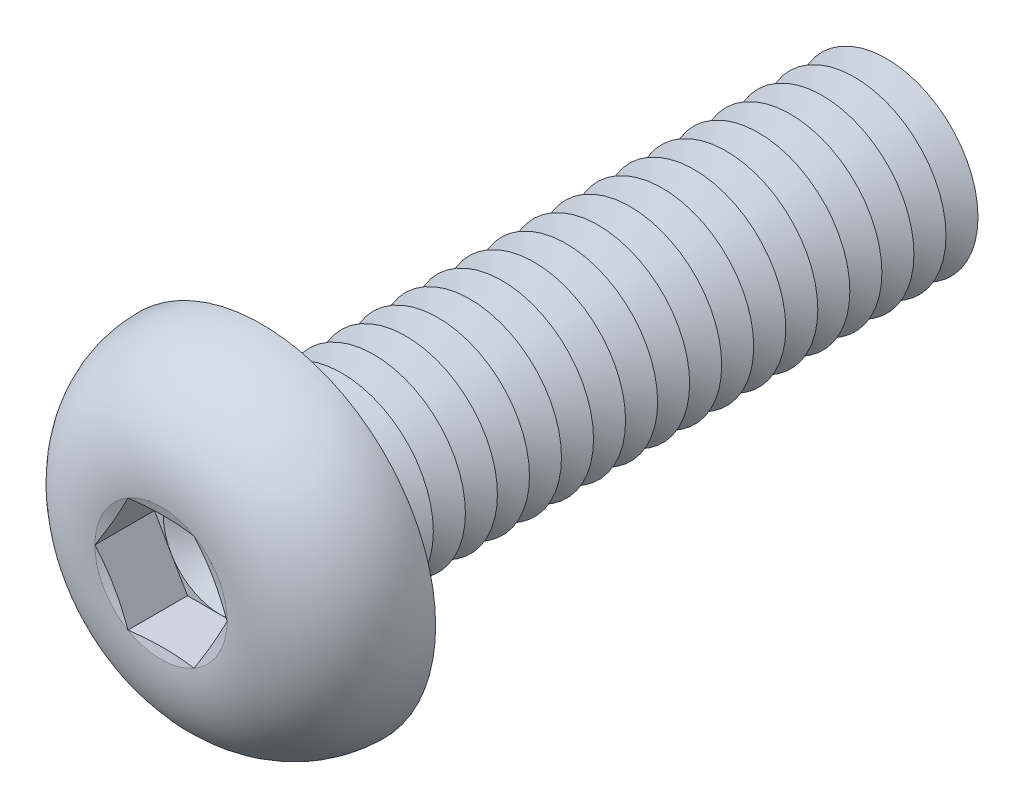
ISO-10303-21;
HEADER;
FILE_DESCRIPTION(('STEP AP214'),'2;1');
FILE_NAME('part.step','',(''),(''),'','','');
FILE_SCHEMA(('AUTOMOTIVE_DESIGN { 1 0 10303 214 1 1 1 1 }'));
ENDSEC;
DATA;
#1=APPLICATION_CONTEXT('core data for automotive mechanical design processes');
#2=APPLICATION_PROTOCOL_DEFINITION('international standard','automotive_design',2000,#1);
#3=PRODUCT_CONTEXT('',#1,'mechanical');
#4=PRODUCT('Part','Part','',(#3));
#5=PRODUCT_RELATED_PRODUCT_CATEGORY('part','',(#4));
#6=PRODUCT_DEFINITION_FORMATION('','',#4);
#7=PRODUCT_DEFINITION_CONTEXT('part definition',#1,'design');
#8=PRODUCT_DEFINITION('design','',#6,#7);
#9=PRODUCT_DEFINITION_SHAPE('','',#8);
#10=(LENGTH_UNIT() NAMED_UNIT(*) SI_UNIT(.MILLI.,.METRE.));
#11=(NAMED_UNIT(*) PLANE_ANGLE_UNIT() SI_UNIT($,.RADIAN.));
#12=(NAMED_UNIT(*) SI_UNIT($,.STERADIAN.) SOLID_ANGLE_UNIT());
#13=UNCERTAINTY_MEASURE_WITH_UNIT(LENGTH_MEASURE(1.E-05),#10,'distance_accuracy_value','');
#14=(GEOMETRIC_REPRESENTATION_CONTEXT(3) GLOBAL_UNCERTAINTY_ASSIGNED_CONTEXT((#13)) GLOBAL_UNIT_ASSIGNED_CONTEXT((#10,
#11,#12)) REPRESENTATION_CONTEXT('',''));
#15=CARTESIAN_POINT('',(0.,0.,0.));
#16=DIRECTION('',(0.,0.,1.));
#17=DIRECTION('',(1.,0.,0.));
#18=AXIS2_PLACEMENT_3D('',#15,#16,#17);
#19=CARTESIAN_POINT('',(0.,0.,0.9));
#20=DIRECTION('',(0.,0.,1.));
#21=DIRECTION('',(1.,0.,0.));
#22=AXIS2_PLACEMENT_3D('',#19,#20,#21);
#23=PLANE('',#22);
#24=CARTESIAN_POINT('',(0.,0.,0.9));
#25=DIRECTION('',(0.,0.,1.));
#26=DIRECTION('',(1.,0.,0.));
#27=AXIS2_PLACEMENT_3D('',#24,#25,#26);
#28=CIRCLE('',#27,1.24999941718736);
#29=CARTESIAN_POINT('',(1.08253125,0.624999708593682,0.9));
#30=VERTEX_POINT('',#29);
#31=CARTESIAN_POINT('',(0.,1.24999941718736,0.9));
#32=VERTEX_POINT('',#31);
#33=EDGE_CURVE('E118',#30,#32,#28,.T.);
#34=ORIENTED_EDGE('',*,*,#33,.F.);
#35=DIRECTION('',(-0.5,0.866025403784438,0.));
#36=VECTOR('',#35,1.);
#37=CARTESIAN_POINT('',(1.443375,0.,0.9));
#38=LINE('',#37,#36);
#39=CARTESIAN_POINT('',(0.7216875,1.24999941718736,0.9));
#40=VERTEX_POINT('',#39);
#41=EDGE_CURVE('E125',#30,#40,#38,.T.);
#42=ORIENTED_EDGE('',*,*,#41,.T.);
#43=DIRECTION('',(-1.,0.,0.));
#44=VECTOR('',#43,1.);
#45=CARTESIAN_POINT('',(0.7216875,1.24999941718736,0.9));
#46=LINE('',#45,#44);
#47=EDGE_CURVE('E136',#40,#32,#46,.T.);
#48=ORIENTED_EDGE('',*,*,#47,.T.);
#49=EDGE_LOOP('',(#34,#42,#48));
#50=FACE_BOUND('',#49,.T.);
#51=ADVANCED_FACE('F39',(#50),#23,.T.);
#52=CARTESIAN_POINT('',(0.,0.,0.9));
#53=DIRECTION('',(0.,0.,1.));
#54=DIRECTION('',(1.,0.,0.));
#55=AXIS2_PLACEMENT_3D('',#52,#53,#54);
#56=CIRCLE('',#55,1.24999941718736);
#57=CARTESIAN_POINT('',(-1.08253125,0.624999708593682,0.9));
#58=VERTEX_POINT('',#57);
#59=EDGE_CURVE('E11',#32,#58,#56,.T.);
#60=ORIENTED_EDGE('',*,*,#59,.F.);
#61=CARTESIAN_POINT('',(-0.721687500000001,1.24999941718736,0.9));
#62=VERTEX_POINT('',#61);
#63=EDGE_CURVE('E131',#32,#62,#46,.T.);
#64=ORIENTED_EDGE('',*,*,#63,.T.);
#65=DIRECTION('',(-0.5,-0.866025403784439,0.));
#66=VECTOR('',#65,1.);
#67=CARTESIAN_POINT('',(-0.721687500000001,1.24999941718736,0.9));
#68=LINE('',#67,#66);
#69=EDGE_CURVE('E134',#62,#58,#68,.T.);
#70=ORIENTED_EDGE('',*,*,#69,.T.);
#71=EDGE_LOOP('',(#60,#64,#70));
#72=FACE_BOUND('',#71,.T.);
#73=ADVANCED_FACE('F130',(#72),#23,.T.);
#74=CARTESIAN_POINT('',(-1.08253125,-0.624999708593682,0.9));
#75=VERTEX_POINT('',#74);
#76=EDGE_CURVE('E49',#58,#75,#56,.T.);
#77=ORIENTED_EDGE('',*,*,#76,.F.);
#78=CARTESIAN_POINT('',(-1.443375,0.,0.9));
#79=VERTEX_POINT('',#78);
#80=EDGE_CURVE('E143',#58,#79,#68,.T.);
#81=ORIENTED_EDGE('',*,*,#80,.T.);
#82=DIRECTION('',(0.5,-0.866025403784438,0.));
#83=VECTOR('',#82,1.);
#84=CARTESIAN_POINT('',(-1.443375,0.,0.9));
#85=LINE('',#84,#83);
#86=EDGE_CURVE('E152',#79,#75,#85,.T.);
#87=ORIENTED_EDGE('',*,*,#86,.T.);
#88=EDGE_LOOP('',(#77,#81,#87));
#89=FACE_BOUND('',#88,.T.);
#90=ADVANCED_FACE('F428',(#89),#23,.T.);
#91=CARTESIAN_POINT('',(0.,-1.24999941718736,0.9));
#92=VERTEX_POINT('',#91);
#93=EDGE_CURVE('E413',#75,#92,#56,.T.);
#94=ORIENTED_EDGE('',*,*,#93,.F.);
#95=CARTESIAN_POINT('',(-0.721687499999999,-1.24999941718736,0.9));
#96=VERTEX_POINT('',#95);
#97=EDGE_CURVE('E151',#75,#96,#85,.T.);
#98=ORIENTED_EDGE('',*,*,#97,.T.);
#99=DIRECTION('',(1.,0.,0.));
#100=VECTOR('',#99,1.);
#101=CARTESIAN_POINT('',(-0.721687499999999,-1.24999941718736,0.9));
#102=LINE('',#101,#100);
#103=EDGE_CURVE('E157',#96,#92,#102,.T.);
#104=ORIENTED_EDGE('',*,*,#103,.T.);
#105=EDGE_LOOP('',(#94,#98,#104));
#106=FACE_BOUND('',#105,.T.);
#107=ADVANCED_FACE('F421',(#106),#23,.T.);
#108=CARTESIAN_POINT('',(1.08253125,-0.624999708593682,0.9));
#109=VERTEX_POINT('',#108);
#110=EDGE_CURVE('E56',#92,#109,#56,.T.);
#111=ORIENTED_EDGE('',*,*,#110,.F.);
#112=CARTESIAN_POINT('',(0.721687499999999,-1.24999941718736,0.9));
#113=VERTEX_POINT('',#112);
#114=EDGE_CURVE('E156',#92,#113,#102,.T.);
#115=ORIENTED_EDGE('',*,*,#114,.T.);
#116=DIRECTION('',(0.5,0.866025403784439,0.));
#117=VECTOR('',#116,1.);
#118=CARTESIAN_POINT('',(0.721687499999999,-1.24999941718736,0.9));
#119=LINE('',#118,#117);
#120=EDGE_CURVE('E162',#113,#109,#119,.T.);
#121=ORIENTED_EDGE('',*,*,#120,.T.);
#122=EDGE_LOOP('',(#111,#115,#121));
#123=FACE_BOUND('',#122,.T.);
#124=ADVANCED_FACE('F507',(#123),#23,.T.);
#125=CARTESIAN_POINT('',(0.,0.,2.2));
#126=DIRECTION('',(0.,0.,1.));
#127=DIRECTION('',(1.,0.,0.));
#128=AXIS2_PLACEMENT_3D('',#125,#126,#127);
#129=CONICAL_SURFACE('',#128,1.443375,1.30899693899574);
#130=CARTESIAN_POINT('',(1.44349047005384,-0.000199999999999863,2.20003094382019));
#131=CARTESIAN_POINT('',(1.41351104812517,0.0517258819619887,2.19199301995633));
#132=CARTESIAN_POINT('',(1.38347725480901,0.10374593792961,2.18469579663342));
#133=CARTESIAN_POINT('',(1.32330355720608,0.207969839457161,2.17187512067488));
#134=CARTESIAN_POINT('',(1.29316361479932,0.260173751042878,2.16635238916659));
#135=CARTESIAN_POINT('',(1.23296043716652,0.364448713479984,2.15740323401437));
#136=CARTESIAN_POINT('',(1.20289760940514,0.416519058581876,2.15396613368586));
#137=CARTESIAN_POINT('',(1.14273359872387,0.520726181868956,2.14935732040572));
#138=CARTESIAN_POINT('',(1.11263242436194,0.572862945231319,2.14818516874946));
#139=CARTESIAN_POINT('',(1.05243007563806,0.677136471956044,2.14818516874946));
#140=CARTESIAN_POINT('',(1.02232890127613,0.729273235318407,2.14935732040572));
#141=CARTESIAN_POINT('',(0.962164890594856,0.833480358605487,2.15396613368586));
#142=CARTESIAN_POINT('',(0.932102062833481,0.885550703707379,2.15740323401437));
#143=CARTESIAN_POINT('',(0.87189888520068,0.989825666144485,2.16635238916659));
#144=CARTESIAN_POINT('',(0.841758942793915,1.0420295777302,2.17187512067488));
#145=CARTESIAN_POINT('',(0.781585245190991,1.14625347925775,2.18469579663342));
#146=CARTESIAN_POINT('',(0.751551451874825,1.19827353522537,2.19199301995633));
#147=CARTESIAN_POINT('',(0.721572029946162,1.25019941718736,2.20003094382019));
#148=B_SPLINE_CURVE_WITH_KNOTS('',3,(#130,#131,#132,#133,#134,#135,#136,#137,#138,#139,#140,
#141,#142,#143,#144,#145,#146,#147),.UNSPECIFIED.,.F.,.F.,(4,2,2,2,2,2,2,2,4),(0.,
0.181495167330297,0.363063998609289,0.543695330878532,0.724291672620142,0.904888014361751,
1.08551934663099,1.26708817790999,1.44858334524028),.UNSPECIFIED.);
#149=CARTESIAN_POINT('',(1.443375,0.,2.2));
#150=VERTEX_POINT('',#149);
#151=CARTESIAN_POINT('',(0.721687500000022,1.24999941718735,2.2));
#152=VERTEX_POINT('',#151);
#153=EDGE_CURVE('E220',#150,#152,#148,.T.);
#154=ORIENTED_EDGE('',*,*,#153,.F.);
#155=CARTESIAN_POINT('',(0.,0.,2.2));
#156=DIRECTION('',(0.,0.,-1.));
#157=DIRECTION('',(-1.,0.,0.));
#158=AXIS2_PLACEMENT_3D('',#155,#156,#157);
#159=CIRCLE('',#158,1.443375);
#160=EDGE_CURVE('E458',#152,#150,#159,.T.);
#161=ORIENTED_EDGE('',*,*,#160,.F.);
#162=EDGE_LOOP('',(#154,#161));
#163=FACE_BOUND('',#162,.T.);
#164=ADVANCED_FACE('F472',(#163),#129,.F.);
#165=CARTESIAN_POINT('',(0.721572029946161,-1.25019941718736,2.20003094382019));
#166=CARTESIAN_POINT('',(0.751551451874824,-1.19827353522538,2.19199301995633));
#167=CARTESIAN_POINT('',(0.78158524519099,-1.14625347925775,2.18469579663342));
#168=CARTESIAN_POINT('',(0.841758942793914,-1.0420295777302,2.17187512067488));
#169=CARTESIAN_POINT('',(0.87189888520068,-0.989825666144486,2.16635238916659));
#170=CARTESIAN_POINT('',(0.932102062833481,-0.88555070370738,2.15740323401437));
#171=CARTESIAN_POINT('',(0.962164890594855,-0.833480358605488,2.15396613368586));
#172=CARTESIAN_POINT('',(1.02232890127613,-0.729273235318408,2.14935732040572));
#173=CARTESIAN_POINT('',(1.05243007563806,-0.677136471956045,2.14818516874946));
#174=CARTESIAN_POINT('',(1.11263242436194,-0.572862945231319,2.14818516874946));
#175=CARTESIAN_POINT('',(1.14273359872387,-0.520726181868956,2.14935732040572));
#176=CARTESIAN_POINT('',(1.20289760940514,-0.416519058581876,2.15396613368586));
#177=CARTESIAN_POINT('',(1.23296043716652,-0.364448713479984,2.15740323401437));
#178=CARTESIAN_POINT('',(1.29316361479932,-0.260173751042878,2.16635238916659));
#179=CARTESIAN_POINT('',(1.32330355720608,-0.207969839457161,2.17187512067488));
#180=CARTESIAN_POINT('',(1.38347725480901,-0.10374593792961,2.18469579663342));
#181=CARTESIAN_POINT('',(1.41351104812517,-0.0517258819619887,2.19199301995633));
#182=CARTESIAN_POINT('',(1.44349047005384,0.000199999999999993,2.20003094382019));
#183=B_SPLINE_CURVE_WITH_KNOTS('',3,(#165,#166,#167,#168,#169,#170,#171,#172,#173,#174,#175,
#176,#177,#178,#179,#180,#181,#182),.UNSPECIFIED.,.F.,.F.,(4,2,2,2,2,2,2,2,4),(0.,
0.181495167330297,0.36306399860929,0.543695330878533,0.724291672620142,0.904888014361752,
1.085519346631,1.26708817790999,1.44858334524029),.UNSPECIFIED.);
#184=CARTESIAN_POINT('',(0.721687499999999,-1.24999941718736,2.2));
#185=VERTEX_POINT('',#184);
#186=EDGE_CURVE('E229',#185,#150,#183,.T.);
#187=ORIENTED_EDGE('',*,*,#186,.F.);
#188=EDGE_CURVE('E460',#150,#185,#159,.T.);
#189=ORIENTED_EDGE('',*,*,#188,.F.);
#190=EDGE_LOOP('',(#187,#189));
#191=FACE_BOUND('',#190,.T.);
#192=ADVANCED_FACE('F475',(#191),#129,.F.);
#193=CARTESIAN_POINT('',(-2.17815859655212,-1.24999941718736,2.48616275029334));
#194=CARTESIAN_POINT('',(-2.07269794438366,-1.24999941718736,2.4616881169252));
#195=CARTESIAN_POINT('',(-1.96714913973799,-1.24999941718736,2.43756889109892));
#196=CARTESIAN_POINT('',(-1.75576352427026,-1.24999941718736,2.39052699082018));
#197=CARTESIAN_POINT('',(-1.64992665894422,-1.24999941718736,2.36760456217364));
#198=CARTESIAN_POINT('',(-1.43690237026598,-1.24999941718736,2.3232454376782));
#199=CARTESIAN_POINT('',(-1.32971158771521,-1.24999941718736,2.30182468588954));
#200=CARTESIAN_POINT('',(-1.1148274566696,-1.24999941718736,2.26156703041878));
#201=CARTESIAN_POINT('',(-1.00713406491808,-1.24999941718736,2.24273035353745));
#202=CARTESIAN_POINT('',(-0.794044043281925,-1.24999941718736,2.2093913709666));
#203=CARTESIAN_POINT('',(-0.688664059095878,-1.24999941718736,2.19478562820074));
#204=CARTESIAN_POINT('',(-0.477310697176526,-1.24999941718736,2.17085809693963));
#205=CARTESIAN_POINT('',(-0.371337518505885,-1.24999941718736,2.16153463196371));
#206=CARTESIAN_POINT('',(-0.159455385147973,-1.24999941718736,2.14976770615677));
#207=CARTESIAN_POINT('',(-0.0535482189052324,-1.24999941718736,2.14729400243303));
#208=CARTESIAN_POINT('',(0.158189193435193,-1.24999941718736,2.14966287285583));
#209=CARTESIAN_POINT('',(0.264019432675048,-1.24999941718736,2.15450603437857));
#210=CARTESIAN_POINT('',(0.445148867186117,-1.24999941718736,2.16825380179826));
#211=CARTESIAN_POINT('',(0.520574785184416,-1.24999941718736,2.17561242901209));
#212=CARTESIAN_POINT('',(0.671115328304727,-1.24999941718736,2.19297000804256));
#213=CARTESIAN_POINT('',(0.746229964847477,-1.24999941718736,2.20296886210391));
#214=CARTESIAN_POINT('',(0.896387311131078,-1.24999941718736,2.22505910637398));
#215=CARTESIAN_POINT('',(0.971429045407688,-1.24999941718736,2.23715700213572));
#216=CARTESIAN_POINT('',(1.12124320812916,-1.24999941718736,2.26292371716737));
#217=CARTESIAN_POINT('',(1.19601562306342,-1.24999941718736,2.27659261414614));
#218=CARTESIAN_POINT('',(1.34686913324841,-1.24999941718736,2.30540811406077));
#219=CARTESIAN_POINT('',(1.42294548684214,-1.24999941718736,2.32057934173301));
#220=CARTESIAN_POINT('',(1.57490676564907,-1.24999941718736,2.351851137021));
#221=CARTESIAN_POINT('',(1.65079168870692,-1.24999941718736,2.36795171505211));
#222=CARTESIAN_POINT('',(1.80199501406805,-1.24999941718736,2.40076814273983));
#223=CARTESIAN_POINT('',(1.87731425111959,-1.24999941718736,2.41748016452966));
#224=CARTESIAN_POINT('',(2.02782424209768,-1.24999941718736,2.45144971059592));
#225=CARTESIAN_POINT('',(2.10301500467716,-1.24999941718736,2.46870719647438));
#226=CARTESIAN_POINT('',(2.17815859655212,-1.24999941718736,2.48616275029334));
#227=B_SPLINE_CURVE_WITH_KNOTS('',3,(#193,#194,#195,#196,#197,#198,#199,#200,#201,#202,#203,
#204,#205,#206,#207,#208,#209,#210,#211,#212,#213,#214,#215,#216,#217,#218,#219,#220,#221,#222,
#223,#224,#225,#226),.UNSPECIFIED.,.F.,.F.,(4,2,2,2,2,2,2,2,2,2,2,2,2,2,2,2,4),(0.,
0.324797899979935,0.649662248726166,0.977572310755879,1.30551113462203,1.62458166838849,
1.94355087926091,2.26110952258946,2.57869365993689,2.80599541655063,3.03328875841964,
3.2612995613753,3.48932164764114,3.7220371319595,3.95475522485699,4.18620606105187,
4.41764064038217),.UNSPECIFIED.);
#228=CARTESIAN_POINT('',(-0.721687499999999,-1.24999941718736,2.2));
#229=VERTEX_POINT('',#228);
#230=EDGE_CURVE('E440',#229,#185,#227,.T.);
#231=ORIENTED_EDGE('',*,*,#230,.F.);
#232=EDGE_CURVE('E448',#185,#229,#159,.T.);
#233=ORIENTED_EDGE('',*,*,#232,.F.);
#234=EDGE_LOOP('',(#231,#233));
#235=FACE_BOUND('',#234,.T.);
#236=ADVANCED_FACE('F480',(#235),#129,.F.);
#237=CARTESIAN_POINT('',(-1.44349047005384,0.000200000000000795,2.20003094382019));
#238=CARTESIAN_POINT('',(-1.41351104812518,-0.0517258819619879,2.19199301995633));
#239=CARTESIAN_POINT('',(-1.38347725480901,-0.10374593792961,2.18469579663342));
#240=CARTESIAN_POINT('',(-1.32330355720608,-0.20796983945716,2.17187512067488));
#241=CARTESIAN_POINT('',(-1.29316361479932,-0.260173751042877,2.16635238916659));
#242=CARTESIAN_POINT('',(-1.23296043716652,-0.364448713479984,2.15740323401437));
#243=CARTESIAN_POINT('',(-1.20289760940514,-0.416519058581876,2.15396613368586));
#244=CARTESIAN_POINT('',(-1.14273359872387,-0.520726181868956,2.14935732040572));
#245=CARTESIAN_POINT('',(-1.11263242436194,-0.572862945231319,2.14818516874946));
#246=CARTESIAN_POINT('',(-1.05243007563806,-0.677136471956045,2.14818516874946));
#247=CARTESIAN_POINT('',(-1.02232890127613,-0.729273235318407,2.14935732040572));
#248=CARTESIAN_POINT('',(-0.962164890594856,-0.833480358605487,2.15396613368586));
#249=CARTESIAN_POINT('',(-0.932102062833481,-0.885550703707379,2.15740323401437));
#250=CARTESIAN_POINT('',(-0.87189888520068,-0.989825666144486,2.16635238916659));
#251=CARTESIAN_POINT('',(-0.841758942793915,-1.0420295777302,2.17187512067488));
#252=CARTESIAN_POINT('',(-0.78158524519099,-1.14625347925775,2.18469579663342));
#253=CARTESIAN_POINT('',(-0.751551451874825,-1.19827353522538,2.19199301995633));
#254=CARTESIAN_POINT('',(-0.721572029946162,-1.25019941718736,2.20003094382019));
#255=B_SPLINE_CURVE_WITH_KNOTS('',3,(#237,#238,#239,#240,#241,#242,#243,#244,#245,#246,#247,
#248,#249,#250,#251,#252,#253,#254),.UNSPECIFIED.,.F.,.F.,(4,2,2,2,2,2,2,2,4),(0.,
0.181495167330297,0.36306399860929,0.543695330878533,0.724291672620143,0.904888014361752,
1.085519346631,1.26708817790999,1.44858334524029),.UNSPECIFIED.);
#256=CARTESIAN_POINT('',(-1.443375,0.,2.2));
#257=VERTEX_POINT('',#256);
#258=EDGE_CURVE('E433',#257,#229,#255,.T.);
#259=ORIENTED_EDGE('',*,*,#258,.F.);
#260=EDGE_CURVE('E395',#229,#257,#159,.T.);
#261=ORIENTED_EDGE('',*,*,#260,.F.);
#262=EDGE_LOOP('',(#259,#261));
#263=FACE_BOUND('',#262,.T.);
#264=ADVANCED_FACE('F437',(#263),#129,.F.);
#265=CARTESIAN_POINT('',(-0.721572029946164,1.25019941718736,2.20003094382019));
#266=CARTESIAN_POINT('',(-0.751551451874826,1.19827353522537,2.19199301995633));
#267=CARTESIAN_POINT('',(-0.781585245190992,1.14625347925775,2.18469579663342));
#268=CARTESIAN_POINT('',(-0.841758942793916,1.0420295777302,2.17187512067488));
#269=CARTESIAN_POINT('',(-0.871898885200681,0.989825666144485,2.16635238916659));
#270=CARTESIAN_POINT('',(-0.932102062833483,0.885550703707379,2.15740323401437));
#271=CARTESIAN_POINT('',(-0.962164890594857,0.833480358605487,2.15396613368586));
#272=CARTESIAN_POINT('',(-1.02232890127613,0.729273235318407,2.14935732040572));
#273=CARTESIAN_POINT('',(-1.05243007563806,0.677136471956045,2.14818516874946));
#274=CARTESIAN_POINT('',(-1.11263242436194,0.572862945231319,2.14818516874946));
#275=CARTESIAN_POINT('',(-1.14273359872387,0.520726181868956,2.14935732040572));
#276=CARTESIAN_POINT('',(-1.20289760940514,0.416519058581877,2.15396613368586));
#277=CARTESIAN_POINT('',(-1.23296043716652,0.364448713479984,2.15740323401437));
#278=CARTESIAN_POINT('',(-1.29316361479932,0.260173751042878,2.16635238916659));
#279=CARTESIAN_POINT('',(-1.32330355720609,0.207969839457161,2.17187512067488));
#280=CARTESIAN_POINT('',(-1.38347725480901,0.103745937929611,2.18469579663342));
#281=CARTESIAN_POINT('',(-1.41351104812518,0.0517258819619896,2.19199301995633));
#282=CARTESIAN_POINT('',(-1.44349047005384,-0.00019999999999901,2.20003094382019));
#283=B_SPLINE_CURVE_WITH_KNOTS('',3,(#265,#266,#267,#268,#269,#270,#271,#272,#273,#274,#275,
#276,#277,#278,#279,#280,#281,#282),.UNSPECIFIED.,.F.,.F.,(4,2,2,2,2,2,2,2,4),(0.,
0.181495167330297,0.363063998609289,0.543695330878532,0.724291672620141,0.90488801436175,
1.08551934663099,1.26708817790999,1.44858334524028),.UNSPECIFIED.);
#284=CARTESIAN_POINT('',(-0.721687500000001,1.24999941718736,2.2));
#285=VERTEX_POINT('',#284);
#286=EDGE_CURVE('E194',#285,#257,#283,.T.);
#287=ORIENTED_EDGE('',*,*,#286,.F.);
#288=EDGE_CURVE('E396',#257,#285,#159,.T.);
#289=ORIENTED_EDGE('',*,*,#288,.F.);
#290=EDGE_LOOP('',(#287,#289));
#291=FACE_BOUND('',#290,.T.);
#292=ADVANCED_FACE('F451',(#291),#129,.F.);
#293=CARTESIAN_POINT('',(0.,0.,-11.55));
#294=DIRECTION('',(0.,0.,1.));
#295=DIRECTION('',(1.,0.,0.));
#296=AXIS2_PLACEMENT_3D('',#293,#294,#295);
#297=CONICAL_SURFACE('',#296,2.00000000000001,1.0471975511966);
#298=CARTESIAN_POINT('',(0.,0.,-11.9));
#299=DIRECTION('',(0.,0.,1.));
#300=DIRECTION('',(1.,0.,0.));
#301=AXIS2_PLACEMENT_3D('',#298,#299,#300);
#302=CIRCLE('',#301,1.3937822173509);
#303=CARTESIAN_POINT('',(1.3937822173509,0.,-11.9));
#304=VERTEX_POINT('',#303);
#305=EDGE_CURVE('E367',#304,#304,#302,.T.);
#306=ORIENTED_EDGE('',*,*,#305,.T.);
#307=EDGE_LOOP('',(#306));
#308=FACE_BOUND('',#307,.T.);
#309=CARTESIAN_POINT('',(0.,0.,-11.55));
#310=DIRECTION('',(0.,0.,1.));
#311=DIRECTION('',(1.,0.,0.));
#312=AXIS2_PLACEMENT_3D('',#309,#310,#311);
#313=CIRCLE('',#312,2.00000000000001);
#314=CARTESIAN_POINT('',(2.00000000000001,0.,-11.55));
#315=VERTEX_POINT('',#314);
#316=EDGE_CURVE('E363',#315,#315,#313,.T.);
#317=ORIENTED_EDGE('',*,*,#316,.F.);
#318=EDGE_LOOP('',(#317));
#319=FACE_BOUND('',#318,.T.);
#320=ADVANCED_FACE('F638',(#308,#319),#297,.T.);
#321=CARTESIAN_POINT('',(0.,0.,-11.9));
#322=DIRECTION('',(0.,0.,-1.));
#323=DIRECTION('',(-1.,0.,0.));
#324=AXIS2_PLACEMENT_3D('',#321,#322,#323);
#325=CONICAL_SURFACE('',#324,1.3937822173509,1.0471975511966);
#326=CARTESIAN_POINT('',(0.,0.,-12.25));
#327=DIRECTION('',(0.,0.,1.));
#328=DIRECTION('',(1.,0.,0.));
#329=AXIS2_PLACEMENT_3D('',#326,#327,#328);
#330=CIRCLE('',#329,2.00000000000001);
#331=CARTESIAN_POINT('',(2.00000000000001,0.,-12.25));
#332=VERTEX_POINT('',#331);
#333=EDGE_CURVE('E371',#332,#332,#330,.T.);
#334=ORIENTED_EDGE('',*,*,#333,.T.);
#335=EDGE_LOOP('',(#334));
#336=FACE_BOUND('',#335,.T.);
#337=ORIENTED_EDGE('',*,*,#305,.F.);
#338=EDGE_LOOP('',(#337));
#339=FACE_BOUND('',#338,.T.);
#340=ADVANCED_FACE('F1000',(#336,#339),#325,.T.);
#341=CARTESIAN_POINT('',(0.,2.00000000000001,-14.));
#342=DIRECTION('',(0.,0.,-1.));
#343=DIRECTION('',(-1.,0.,0.));
#344=AXIS2_PLACEMENT_3D('',#341,#342,#343);
#345=PLANE('',#344);
#346=CARTESIAN_POINT('',(0.,0.,-14.));
#347=DIRECTION('',(0.,0.,1.));
#348=DIRECTION('',(1.,0.,0.));
#349=AXIS2_PLACEMENT_3D('',#346,#347,#348);
#350=CIRCLE('',#349,1.3937822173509);
#351=CARTESIAN_POINT('',(1.3937822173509,0.,-14.));
#352=VERTEX_POINT('',#351);
#353=EDGE_CURVE('E391',#352,#352,#350,.T.);
#354=ORIENTED_EDGE('',*,*,#353,.F.);
#355=EDGE_LOOP('',(#354));
#356=FACE_BOUND('',#355,.T.);
#357=ADVANCED_FACE('F1005',(#356),#345,.T.);
#358=CARTESIAN_POINT('',(0.,0.,-13.65));
#359=DIRECTION('',(0.,0.,1.));
#360=DIRECTION('',(1.,0.,0.));
#361=AXIS2_PLACEMENT_3D('',#358,#359,#360);
#362=CONICAL_SURFACE('',#361,2.00000000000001,1.0471975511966);
#363=ORIENTED_EDGE('',*,*,#353,.T.);
#364=EDGE_LOOP('',(#363));
#365=FACE_BOUND('',#364,.T.);
#366=CARTESIAN_POINT('',(0.,0.,-13.65));
#367=DIRECTION('',(0.,0.,1.));
#368=DIRECTION('',(1.,0.,0.));
#369=AXIS2_PLACEMENT_3D('',#366,#367,#368);
#370=CIRCLE('',#369,2.00000000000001);
#371=CARTESIAN_POINT('',(2.00000000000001,0.,-13.65));
#372=VERTEX_POINT('',#371);
#373=EDGE_CURVE('E387',#372,#372,#370,.T.);
#374=ORIENTED_EDGE('',*,*,#373,.F.);
#375=EDGE_LOOP('',(#374));
#376=FACE_BOUND('',#375,.T.);
#377=ADVANCED_FACE('F994',(#365,#376),#362,.T.);
#378=CARTESIAN_POINT('',(0.,0.,-13.3));
#379=DIRECTION('',(0.,0.,-1.));
#380=DIRECTION('',(-1.,0.,0.));
#381=AXIS2_PLACEMENT_3D('',#378,#379,#380);
#382=CONICAL_SURFACE('',#381,1.3937822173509,1.0471975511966);
#383=ORIENTED_EDGE('',*,*,#373,.T.);
#384=EDGE_LOOP('',(#383));
#385=FACE_BOUND('',#384,.T.);
#386=CARTESIAN_POINT('',(0.,0.,-13.3));
#387=DIRECTION('',(0.,0.,1.));
#388=DIRECTION('',(1.,0.,0.));
#389=AXIS2_PLACEMENT_3D('',#386,#387,#388);
#390=CIRCLE('',#389,1.3937822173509);
#391=CARTESIAN_POINT('',(1.3937822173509,0.,-13.3));
#392=VERTEX_POINT('',#391);
#393=EDGE_CURVE('E383',#392,#392,#390,.T.);
#394=ORIENTED_EDGE('',*,*,#393,.F.);
#395=EDGE_LOOP('',(#394));
#396=FACE_BOUND('',#395,.T.);
#397=ADVANCED_FACE('F984',(#385,#396),#382,.T.);
#398=CARTESIAN_POINT('',(0.,0.,-12.95));
#399=DIRECTION('',(0.,0.,1.));
#400=DIRECTION('',(1.,0.,0.));
#401=AXIS2_PLACEMENT_3D('',#398,#399,#400);
#402=CONICAL_SURFACE('',#401,2.00000000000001,1.0471975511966);
#403=ORIENTED_EDGE('',*,*,#393,.T.);
#404=EDGE_LOOP('',(#403));
#405=FACE_BOUND('',#404,.T.);
#406=CARTESIAN_POINT('',(0.,0.,-12.95));
#407=DIRECTION('',(0.,0.,1.));
#408=DIRECTION('',(1.,0.,0.));
#409=AXIS2_PLACEMENT_3D('',#406,#407,#408);
#410=CIRCLE('',#409,2.00000000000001);
#411=CARTESIAN_POINT('',(2.00000000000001,0.,-12.95));
#412=VERTEX_POINT('',#411);
#413=EDGE_CURVE('E379',#412,#412,#410,.T.);
#414=ORIENTED_EDGE('',*,*,#413,.F.);
#415=EDGE_LOOP('',(#414));
#416=FACE_BOUND('',#415,.T.);
#417=ADVANCED_FACE('F974',(#405,#416),#402,.T.);
#418=CARTESIAN_POINT('',(0.,0.,-12.6));
#419=DIRECTION('',(0.,0.,-1.));
#420=DIRECTION('',(-1.,0.,0.));
#421=AXIS2_PLACEMENT_3D('',#418,#419,#420);
#422=CONICAL_SURFACE('',#421,1.3937822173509,1.0471975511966);
#423=ORIENTED_EDGE('',*,*,#413,.T.);
#424=EDGE_LOOP('',(#423));
#425=FACE_BOUND('',#424,.T.);
#426=CARTESIAN_POINT('',(0.,0.,-12.6));
#427=DIRECTION('',(0.,0.,1.));
#428=DIRECTION('',(1.,0.,0.));
#429=AXIS2_PLACEMENT_3D('',#426,#427,#428);
#430=CIRCLE('',#429,1.3937822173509);
#431=CARTESIAN_POINT('',(1.3937822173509,0.,-12.6));
#432=VERTEX_POINT('',#431);
#433=EDGE_CURVE('E375',#432,#432,#430,.T.);
#434=ORIENTED_EDGE('',*,*,#433,.F.);
#435=EDGE_LOOP('',(#434));
#436=FACE_BOUND('',#435,.T.);
#437=ADVANCED_FACE('F964',(#425,#436),#422,.T.);
#438=CARTESIAN_POINT('',(0.,0.,-12.25));
#439=DIRECTION('',(0.,0.,1.));
#440=DIRECTION('',(1.,0.,0.));
#441=AXIS2_PLACEMENT_3D('',#438,#439,#440);
#442=CONICAL_SURFACE('',#441,2.00000000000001,1.0471975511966);
#443=ORIENTED_EDGE('',*,*,#433,.T.);
#444=EDGE_LOOP('',(#443));
#445=FACE_BOUND('',#444,.T.);
#446=ORIENTED_EDGE('',*,*,#333,.F.);
#447=EDGE_LOOP('',(#446));
#448=FACE_BOUND('',#447,.T.);
#449=ADVANCED_FACE('F954',(#445,#448),#442,.T.);
#450=CARTESIAN_POINT('',(0.,0.,-10.85));
#451=DIRECTION('',(0.,0.,1.));
#452=DIRECTION('',(1.,0.,0.));
#453=AXIS2_PLACEMENT_3D('',#450,#451,#452);
#454=CONICAL_SURFACE('',#453,2.00000000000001,1.0471975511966);
#455=CARTESIAN_POINT('',(0.,0.,-11.2));
#456=DIRECTION('',(0.,0.,1.));
#457=DIRECTION('',(1.,0.,0.));
#458=AXIS2_PLACEMENT_3D('',#455,#456,#457);
#459=CIRCLE('',#458,1.3937822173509);
#460=CARTESIAN_POINT('',(1.3937822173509,0.,-11.2));
#461=VERTEX_POINT('',#460);
#462=EDGE_CURVE('E359',#461,#461,#459,.T.);
#463=ORIENTED_EDGE('',*,*,#462,.T.);
#464=EDGE_LOOP('',(#463));
#465=FACE_BOUND('',#464,.T.);
#466=CARTESIAN_POINT('',(0.,0.,-10.85));
#467=DIRECTION('',(0.,0.,1.));
#468=DIRECTION('',(1.,0.,0.));
#469=AXIS2_PLACEMENT_3D('',#466,#467,#468);
#470=CIRCLE('',#469,2.00000000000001);
#471=CARTESIAN_POINT('',(2.00000000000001,0.,-10.85));
#472=VERTEX_POINT('',#471);
#473=EDGE_CURVE('E355',#472,#472,#470,.T.);
#474=ORIENTED_EDGE('',*,*,#473,.F.);
#475=EDGE_LOOP('',(#474));
#476=FACE_BOUND('',#475,.T.);
#477=ADVANCED_FACE('F944',(#465,#476),#454,.T.);
#478=CARTESIAN_POINT('',(0.,0.,-11.2));
#479=DIRECTION('',(0.,0.,-1.));
#480=DIRECTION('',(-1.,0.,0.));
#481=AXIS2_PLACEMENT_3D('',#478,#479,#480);
#482=CONICAL_SURFACE('',#481,1.3937822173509,1.0471975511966);
#483=ORIENTED_EDGE('',*,*,#316,.T.);
#484=EDGE_LOOP('',(#483));
#485=FACE_BOUND('',#484,.T.);
#486=ORIENTED_EDGE('',*,*,#462,.F.);
#487=EDGE_LOOP('',(#486));
#488=FACE_BOUND('',#487,.T.);
#489=ADVANCED_FACE('F934',(#485,#488),#482,.T.);
#490=CARTESIAN_POINT('',(0.,0.,-10.15));
#491=DIRECTION('',(0.,0.,1.));
#492=DIRECTION('',(1.,0.,0.));
#493=AXIS2_PLACEMENT_3D('',#490,#491,#492);
#494=CONICAL_SURFACE('',#493,2.00000000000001,1.0471975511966);
#495=CARTESIAN_POINT('',(0.,0.,-10.5));
#496=DIRECTION('',(0.,0.,1.));
#497=DIRECTION('',(1.,0.,0.));
#498=AXIS2_PLACEMENT_3D('',#495,#496,#497);
#499=CIRCLE('',#498,1.3937822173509);
#500=CARTESIAN_POINT('',(1.3937822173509,0.,-10.5));
#501=VERTEX_POINT('',#500);
#502=EDGE_CURVE('E351',#501,#501,#499,.T.);
#503=ORIENTED_EDGE('',*,*,#502,.T.);
#504=EDGE_LOOP('',(#503));
#505=FACE_BOUND('',#504,.T.);
#506=CARTESIAN_POINT('',(0.,0.,-10.15));
#507=DIRECTION('',(0.,0.,1.));
#508=DIRECTION('',(1.,0.,0.));
#509=AXIS2_PLACEMENT_3D('',#506,#507,#508);
#510=CIRCLE('',#509,2.00000000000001);
#511=CARTESIAN_POINT('',(2.00000000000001,0.,-10.15));
#512=VERTEX_POINT('',#511);
#513=EDGE_CURVE('E347',#512,#512,#510,.T.);
#514=ORIENTED_EDGE('',*,*,#513,.F.);
#515=EDGE_LOOP('',(#514));
#516=FACE_BOUND('',#515,.T.);
#517=ADVANCED_FACE('F924',(#505,#516),#494,.T.);
#518=CARTESIAN_POINT('',(0.,0.,-10.5));
#519=DIRECTION('',(0.,0.,-1.));
#520=DIRECTION('',(-1.,0.,0.));
#521=AXIS2_PLACEMENT_3D('',#518,#519,#520);
#522=CONICAL_SURFACE('',#521,1.3937822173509,1.0471975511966);
#523=ORIENTED_EDGE('',*,*,#473,.T.);
#524=EDGE_LOOP('',(#523));
#525=FACE_BOUND('',#524,.T.);
#526=ORIENTED_EDGE('',*,*,#502,.F.);
#527=EDGE_LOOP('',(#526));
#528=FACE_BOUND('',#527,.T.);
#529=ADVANCED_FACE('F914',(#525,#528),#522,.T.);
#530=CARTESIAN_POINT('',(0.,0.,-9.45));
#531=DIRECTION('',(0.,0.,1.));
#532=DIRECTION('',(1.,0.,0.));
#533=AXIS2_PLACEMENT_3D('',#530,#531,#532);
#534=CONICAL_SURFACE('',#533,2.00000000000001,1.0471975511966);
#535=CARTESIAN_POINT('',(0.,0.,-9.8));
#536=DIRECTION('',(0.,0.,1.));
#537=DIRECTION('',(1.,0.,0.));
#538=AXIS2_PLACEMENT_3D('',#535,#536,#537);
#539=CIRCLE('',#538,1.3937822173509);
#540=CARTESIAN_POINT('',(1.3937822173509,0.,-9.8));
#541=VERTEX_POINT('',#540);
#542=EDGE_CURVE('E343',#541,#541,#539,.T.);
#543=ORIENTED_EDGE('',*,*,#542,.T.);
#544=EDGE_LOOP('',(#543));
#545=FACE_BOUND('',#544,.T.);
#546=CARTESIAN_POINT('',(0.,0.,-9.45));
#547=DIRECTION('',(0.,0.,1.));
#548=DIRECTION('',(1.,0.,0.));
#549=AXIS2_PLACEMENT_3D('',#546,#547,#548);
#550=CIRCLE('',#549,2.00000000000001);
#551=CARTESIAN_POINT('',(2.00000000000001,0.,-9.45));
#552=VERTEX_POINT('',#551);
#553=EDGE_CURVE('E339',#552,#552,#550,.T.);
#554=ORIENTED_EDGE('',*,*,#553,.F.);
#555=EDGE_LOOP('',(#554));
#556=FACE_BOUND('',#555,.T.);
#557=ADVANCED_FACE('F904',(#545,#556),#534,.T.);
#558=CARTESIAN_POINT('',(0.,0.,-9.8));
#559=DIRECTION('',(0.,0.,-1.));
#560=DIRECTION('',(-1.,0.,0.));
#561=AXIS2_PLACEMENT_3D('',#558,#559,#560);
#562=CONICAL_SURFACE('',#561,1.3937822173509,1.0471975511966);
#563=ORIENTED_EDGE('',*,*,#513,.T.);
#564=EDGE_LOOP('',(#563));
#565=FACE_BOUND('',#564,.T.);
#566=ORIENTED_EDGE('',*,*,#542,.F.);
#567=EDGE_LOOP('',(#566));
#568=FACE_BOUND('',#567,.T.);
#569=ADVANCED_FACE('F894',(#565,#568),#562,.T.);
#570=CARTESIAN_POINT('',(0.,0.,-8.75));
#571=DIRECTION('',(0.,0.,1.));
#572=DIRECTION('',(1.,0.,0.));
#573=AXIS2_PLACEMENT_3D('',#570,#571,#572);
#574=CONICAL_SURFACE('',#573,2.00000000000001,1.0471975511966);
#575=CARTESIAN_POINT('',(0.,0.,-9.1));
#576=DIRECTION('',(0.,0.,1.));
#577=DIRECTION('',(1.,0.,0.));
#578=AXIS2_PLACEMENT_3D('',#575,#576,#577);
#579=CIRCLE('',#578,1.3937822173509);
#580=CARTESIAN_POINT('',(1.3937822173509,0.,-9.1));
#581=VERTEX_POINT('',#580);
#582=EDGE_CURVE('E335',#581,#581,#579,.T.);
#583=ORIENTED_EDGE('',*,*,#582,.T.);
#584=EDGE_LOOP('',(#583));
#585=FACE_BOUND('',#584,.T.);
#586=CARTESIAN_POINT('',(0.,0.,-8.75));
#587=DIRECTION('',(0.,0.,1.));
#588=DIRECTION('',(1.,0.,0.));
#589=AXIS2_PLACEMENT_3D('',#586,#587,#588);
#590=CIRCLE('',#589,2.00000000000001);
#591=CARTESIAN_POINT('',(2.00000000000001,0.,-8.75));
#592=VERTEX_POINT('',#591);
#593=EDGE_CURVE('E331',#592,#592,#590,.T.);
#594=ORIENTED_EDGE('',*,*,#593,.F.);
#595=EDGE_LOOP('',(#594));
#596=FACE_BOUND('',#595,.T.);
#597=ADVANCED_FACE('F884',(#585,#596),#574,.T.);
#598=CARTESIAN_POINT('',(0.,0.,-9.1));
#599=DIRECTION('',(0.,0.,-1.));
#600=DIRECTION('',(-1.,0.,0.));
#601=AXIS2_PLACEMENT_3D('',#598,#599,#600);
#602=CONICAL_SURFACE('',#601,1.3937822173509,1.0471975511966);
#603=ORIENTED_EDGE('',*,*,#553,.T.);
#604=EDGE_LOOP('',(#603));
#605=FACE_BOUND('',#604,.T.);
#606=ORIENTED_EDGE('',*,*,#582,.F.);
#607=EDGE_LOOP('',(#606));
#608=FACE_BOUND('',#607,.T.);
#609=ADVANCED_FACE('F874',(#605,#608),#602,.T.);
#610=CARTESIAN_POINT('',(0.,0.,-8.05));
#611=DIRECTION('',(0.,0.,1.));
#612=DIRECTION('',(1.,0.,0.));
#613=AXIS2_PLACEMENT_3D('',#610,#611,#612);
#614=CONICAL_SURFACE('',#613,2.00000000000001,1.0471975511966);
#615=CARTESIAN_POINT('',(0.,0.,-8.4));
#616=DIRECTION('',(0.,0.,1.));
#617=DIRECTION('',(1.,0.,0.));
#618=AXIS2_PLACEMENT_3D('',#615,#616,#617);
#619=CIRCLE('',#618,1.3937822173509);
#620=CARTESIAN_POINT('',(1.3937822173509,0.,-8.4));
#621=VERTEX_POINT('',#620);
#622=EDGE_CURVE('E327',#621,#621,#619,.T.);
#623=ORIENTED_EDGE('',*,*,#622,.T.);
#624=EDGE_LOOP('',(#623));
#625=FACE_BOUND('',#624,.T.);
#626=CARTESIAN_POINT('',(0.,0.,-8.05));
#627=DIRECTION('',(0.,0.,1.));
#628=DIRECTION('',(1.,0.,0.));
#629=AXIS2_PLACEMENT_3D('',#626,#627,#628);
#630=CIRCLE('',#629,2.00000000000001);
#631=CARTESIAN_POINT('',(2.00000000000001,0.,-8.05));
#632=VERTEX_POINT('',#631);
#633=EDGE_CURVE('E323',#632,#632,#630,.T.);
#634=ORIENTED_EDGE('',*,*,#633,.F.);
#635=EDGE_LOOP('',(#634));
#636=FACE_BOUND('',#635,.T.);
#637=ADVANCED_FACE('F864',(#625,#636),#614,.T.);
#638=CARTESIAN_POINT('',(0.,0.,-8.4));
#639=DIRECTION('',(0.,0.,-1.));
#640=DIRECTION('',(-1.,0.,0.));
#641=AXIS2_PLACEMENT_3D('',#638,#639,#640);
#642=CONICAL_SURFACE('',#641,1.3937822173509,1.0471975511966);
#643=ORIENTED_EDGE('',*,*,#593,.T.);
#644=EDGE_LOOP('',(#643));
#645=FACE_BOUND('',#644,.T.);
#646=ORIENTED_EDGE('',*,*,#622,.F.);
#647=EDGE_LOOP('',(#646));
#648=FACE_BOUND('',#647,.T.);
#649=ADVANCED_FACE('F854',(#645,#648),#642,.T.);
#650=CARTESIAN_POINT('',(0.,0.,-7.35));
#651=DIRECTION('',(0.,0.,1.));
#652=DIRECTION('',(1.,0.,0.));
#653=AXIS2_PLACEMENT_3D('',#650,#651,#652);
#654=CONICAL_SURFACE('',#653,2.00000000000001,1.0471975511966);
#655=CARTESIAN_POINT('',(0.,0.,-7.7));
#656=DIRECTION('',(0.,0.,1.));
#657=DIRECTION('',(1.,0.,0.));
#658=AXIS2_PLACEMENT_3D('',#655,#656,#657);
#659=CIRCLE('',#658,1.3937822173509);
#660=CARTESIAN_POINT('',(1.3937822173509,0.,-7.7));
#661=VERTEX_POINT('',#660);
#662=EDGE_CURVE('E319',#661,#661,#659,.T.);
#663=ORIENTED_EDGE('',*,*,#662,.T.);
#664=EDGE_LOOP('',(#663));
#665=FACE_BOUND('',#664,.T.);
#666=CARTESIAN_POINT('',(0.,0.,-7.35));
#667=DIRECTION('',(0.,0.,1.));
#668=DIRECTION('',(1.,0.,0.));
#669=AXIS2_PLACEMENT_3D('',#666,#667,#668);
#670=CIRCLE('',#669,2.00000000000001);
#671=CARTESIAN_POINT('',(2.00000000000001,0.,-7.35));
#672=VERTEX_POINT('',#671);
#673=EDGE_CURVE('E315',#672,#672,#670,.T.);
#674=ORIENTED_EDGE('',*,*,#673,.F.);
#675=EDGE_LOOP('',(#674));
#676=FACE_BOUND('',#675,.T.);
#677=ADVANCED_FACE('F844',(#665,#676),#654,.T.);
#678=CARTESIAN_POINT('',(0.,0.,-7.7));
#679=DIRECTION('',(0.,0.,-1.));
#680=DIRECTION('',(-1.,0.,0.));
#681=AXIS2_PLACEMENT_3D('',#678,#679,#680);
#682=CONICAL_SURFACE('',#681,1.3937822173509,1.0471975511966);
#683=ORIENTED_EDGE('',*,*,#633,.T.);
#684=EDGE_LOOP('',(#683));
#685=FACE_BOUND('',#684,.T.);
#686=ORIENTED_EDGE('',*,*,#662,.F.);
#687=EDGE_LOOP('',(#686));
#688=FACE_BOUND('',#687,.T.);
#689=ADVANCED_FACE('F834',(#685,#688),#682,.T.);
#690=CARTESIAN_POINT('',(0.,0.,-6.65));
#691=DIRECTION('',(0.,0.,1.));
#692=DIRECTION('',(1.,0.,0.));
#693=AXIS2_PLACEMENT_3D('',#690,#691,#692);
#694=CONICAL_SURFACE('',#693,2.00000000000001,1.0471975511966);
#695=CARTESIAN_POINT('',(0.,0.,-7.));
#696=DIRECTION('',(0.,0.,1.));
#697=DIRECTION('',(1.,0.,0.));
#698=AXIS2_PLACEMENT_3D('',#695,#696,#697);
#699=CIRCLE('',#698,1.3937822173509);
#700=CARTESIAN_POINT('',(1.3937822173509,0.,-7.));
#701=VERTEX_POINT('',#700);
#702=EDGE_CURVE('E311',#701,#701,#699,.T.);
#703=ORIENTED_EDGE('',*,*,#702,.T.);
#704=EDGE_LOOP('',(#703));
#705=FACE_BOUND('',#704,.T.);
#706=CARTESIAN_POINT('',(0.,0.,-6.65));
#707=DIRECTION('',(0.,0.,1.));
#708=DIRECTION('',(1.,0.,0.));
#709=AXIS2_PLACEMENT_3D('',#706,#707,#708);
#710=CIRCLE('',#709,2.00000000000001);
#711=CARTESIAN_POINT('',(2.00000000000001,0.,-6.65));
#712=VERTEX_POINT('',#711);
#713=EDGE_CURVE('E307',#712,#712,#710,.T.);
#714=ORIENTED_EDGE('',*,*,#713,.F.);
#715=EDGE_LOOP('',(#714));
#716=FACE_BOUND('',#715,.T.);
#717=ADVANCED_FACE('F824',(#705,#716),#694,.T.);
#718=CARTESIAN_POINT('',(0.,0.,-7.));
#719=DIRECTION('',(0.,0.,-1.));
#720=DIRECTION('',(-1.,0.,0.));
#721=AXIS2_PLACEMENT_3D('',#718,#719,#720);
#722=CONICAL_SURFACE('',#721,1.3937822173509,1.0471975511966);
#723=ORIENTED_EDGE('',*,*,#673,.T.);
#724=EDGE_LOOP('',(#723));
#725=FACE_BOUND('',#724,.T.);
#726=ORIENTED_EDGE('',*,*,#702,.F.);
#727=EDGE_LOOP('',(#726));
#728=FACE_BOUND('',#727,.T.);
#729=ADVANCED_FACE('F814',(#725,#728),#722,.T.);
#730=CARTESIAN_POINT('',(0.,0.,-5.95));
#731=DIRECTION('',(0.,0.,1.));
#732=DIRECTION('',(1.,0.,0.));
#733=AXIS2_PLACEMENT_3D('',#730,#731,#732);
#734=CONICAL_SURFACE('',#733,2.00000000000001,1.0471975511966);
#735=CARTESIAN_POINT('',(0.,0.,-6.3));
#736=DIRECTION('',(0.,0.,1.));
#737=DIRECTION('',(1.,0.,0.));
#738=AXIS2_PLACEMENT_3D('',#735,#736,#737);
#739=CIRCLE('',#738,1.3937822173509);
#740=CARTESIAN_POINT('',(1.3937822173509,0.,-6.3));
#741=VERTEX_POINT('',#740);
#742=EDGE_CURVE('E303',#741,#741,#739,.T.);
#743=ORIENTED_EDGE('',*,*,#742,.T.);
#744=EDGE_LOOP('',(#743));
#745=FACE_BOUND('',#744,.T.);
#746=CARTESIAN_POINT('',(0.,0.,-5.95));
#747=DIRECTION('',(0.,0.,1.));
#748=DIRECTION('',(1.,0.,0.));
#749=AXIS2_PLACEMENT_3D('',#746,#747,#748);
#750=CIRCLE('',#749,2.00000000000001);
#751=CARTESIAN_POINT('',(2.00000000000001,0.,-5.95));
#752=VERTEX_POINT('',#751);
#753=EDGE_CURVE('E299',#752,#752,#750,.T.);
#754=ORIENTED_EDGE('',*,*,#753,.F.);
#755=EDGE_LOOP('',(#754));
#756=FACE_BOUND('',#755,.T.);
#757=ADVANCED_FACE('F804',(#745,#756),#734,.T.);
#758=CARTESIAN_POINT('',(0.,0.,-6.3));
#759=DIRECTION('',(0.,0.,-1.));
#760=DIRECTION('',(-1.,0.,0.));
#761=AXIS2_PLACEMENT_3D('',#758,#759,#760);
#762=CONICAL_SURFACE('',#761,1.3937822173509,1.0471975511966);
#763=ORIENTED_EDGE('',*,*,#713,.T.);
#764=EDGE_LOOP('',(#763));
#765=FACE_BOUND('',#764,.T.);
#766=ORIENTED_EDGE('',*,*,#742,.F.);
#767=EDGE_LOOP('',(#766));
#768=FACE_BOUND('',#767,.T.);
#769=ADVANCED_FACE('F794',(#765,#768),#762,.T.);
#770=CARTESIAN_POINT('',(0.,0.,-5.25));
#771=DIRECTION('',(0.,0.,1.));
#772=DIRECTION('',(1.,0.,0.));
#773=AXIS2_PLACEMENT_3D('',#770,#771,#772);
#774=CONICAL_SURFACE('',#773,2.00000000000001,1.0471975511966);
#775=CARTESIAN_POINT('',(0.,0.,-5.6));
#776=DIRECTION('',(0.,0.,1.));
#777=DIRECTION('',(1.,0.,0.));
#778=AXIS2_PLACEMENT_3D('',#775,#776,#777);
#779=CIRCLE('',#778,1.3937822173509);
#780=CARTESIAN_POINT('',(1.3937822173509,0.,-5.6));
#781=VERTEX_POINT('',#780);
#782=EDGE_CURVE('E295',#781,#781,#779,.T.);
#783=ORIENTED_EDGE('',*,*,#782,.T.);
#784=EDGE_LOOP('',(#783));
#785=FACE_BOUND('',#784,.T.);
#786=CARTESIAN_POINT('',(0.,0.,-5.25));
#787=DIRECTION('',(0.,0.,1.));
#788=DIRECTION('',(1.,0.,0.));
#789=AXIS2_PLACEMENT_3D('',#786,#787,#788);
#790=CIRCLE('',#789,2.00000000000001);
#791=CARTESIAN_POINT('',(2.00000000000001,0.,-5.25));
#792=VERTEX_POINT('',#791);
#793=EDGE_CURVE('E291',#792,#792,#790,.T.);
#794=ORIENTED_EDGE('',*,*,#793,.F.);
#795=EDGE_LOOP('',(#794));
#796=FACE_BOUND('',#795,.T.);
#797=ADVANCED_FACE('F784',(#785,#796),#774,.T.);
#798=CARTESIAN_POINT('',(0.,0.,-5.6));
#799=DIRECTION('',(0.,0.,-1.));
#800=DIRECTION('',(-1.,0.,0.));
#801=AXIS2_PLACEMENT_3D('',#798,#799,#800);
#802=CONICAL_SURFACE('',#801,1.3937822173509,1.0471975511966);
#803=ORIENTED_EDGE('',*,*,#753,.T.);
#804=EDGE_LOOP('',(#803));
#805=FACE_BOUND('',#804,.T.);
#806=ORIENTED_EDGE('',*,*,#782,.F.);
#807=EDGE_LOOP('',(#806));
#808=FACE_BOUND('',#807,.T.);
#809=ADVANCED_FACE('F774',(#805,#808),#802,.T.);
#810=CARTESIAN_POINT('',(0.,0.,-4.55));
#811=DIRECTION('',(0.,0.,1.));
#812=DIRECTION('',(1.,0.,0.));
#813=AXIS2_PLACEMENT_3D('',#810,#811,#812);
#814=CONICAL_SURFACE('',#813,2.00000000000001,1.0471975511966);
#815=CARTESIAN_POINT('',(0.,0.,-4.9));
#816=DIRECTION('',(0.,0.,1.));
#817=DIRECTION('',(1.,0.,0.));
#818=AXIS2_PLACEMENT_3D('',#815,#816,#817);
#819=CIRCLE('',#818,1.3937822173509);
#820=CARTESIAN_POINT('',(1.3937822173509,0.,-4.9));
#821=VERTEX_POINT('',#820);
#822=EDGE_CURVE('E287',#821,#821,#819,.T.);
#823=ORIENTED_EDGE('',*,*,#822,.T.);
#824=EDGE_LOOP('',(#823));
#825=FACE_BOUND('',#824,.T.);
#826=CARTESIAN_POINT('',(0.,0.,-4.55));
#827=DIRECTION('',(0.,0.,1.));
#828=DIRECTION('',(1.,0.,0.));
#829=AXIS2_PLACEMENT_3D('',#826,#827,#828);
#830=CIRCLE('',#829,2.00000000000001);
#831=CARTESIAN_POINT('',(2.00000000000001,0.,-4.55));
#832=VERTEX_POINT('',#831);
#833=EDGE_CURVE('E283',#832,#832,#830,.T.);
#834=ORIENTED_EDGE('',*,*,#833,.F.);
#835=EDGE_LOOP('',(#834));
#836=FACE_BOUND('',#835,.T.);
#837=ADVANCED_FACE('F764',(#825,#836),#814,.T.);
#838=CARTESIAN_POINT('',(0.,0.,-4.9));
#839=DIRECTION('',(0.,0.,-1.));
#840=DIRECTION('',(-1.,0.,0.));
#841=AXIS2_PLACEMENT_3D('',#838,#839,#840);
#842=CONICAL_SURFACE('',#841,1.3937822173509,1.0471975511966);
#843=ORIENTED_EDGE('',*,*,#793,.T.);
#844=EDGE_LOOP('',(#843));
#845=FACE_BOUND('',#844,.T.);
#846=ORIENTED_EDGE('',*,*,#822,.F.);
#847=EDGE_LOOP('',(#846));
#848=FACE_BOUND('',#847,.T.);
#849=ADVANCED_FACE('F754',(#845,#848),#842,.T.);
#850=CARTESIAN_POINT('',(0.,0.,-3.85));
#851=DIRECTION('',(0.,0.,1.));
#852=DIRECTION('',(1.,0.,0.));
#853=AXIS2_PLACEMENT_3D('',#850,#851,#852);
#854=CONICAL_SURFACE('',#853,2.00000000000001,1.0471975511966);
#855=CARTESIAN_POINT('',(0.,0.,-4.2));
#856=DIRECTION('',(0.,0.,1.));
#857=DIRECTION('',(1.,0.,0.));
#858=AXIS2_PLACEMENT_3D('',#855,#856,#857);
#859=CIRCLE('',#858,1.3937822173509);
#860=CARTESIAN_POINT('',(1.3937822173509,0.,-4.2));
#861=VERTEX_POINT('',#860);
#862=EDGE_CURVE('E279',#861,#861,#859,.T.);
#863=ORIENTED_EDGE('',*,*,#862,.T.);
#864=EDGE_LOOP('',(#863));
#865=FACE_BOUND('',#864,.T.);
#866=CARTESIAN_POINT('',(0.,0.,-3.85));
#867=DIRECTION('',(0.,0.,1.));
#868=DIRECTION('',(1.,0.,0.));
#869=AXIS2_PLACEMENT_3D('',#866,#867,#868);
#870=CIRCLE('',#869,2.00000000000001);
#871=CARTESIAN_POINT('',(2.00000000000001,0.,-3.85));
#872=VERTEX_POINT('',#871);
#873=EDGE_CURVE('E275',#872,#872,#870,.T.);
#874=ORIENTED_EDGE('',*,*,#873,.F.);
#875=EDGE_LOOP('',(#874));
#876=FACE_BOUND('',#875,.T.);
#877=ADVANCED_FACE('F744',(#865,#876),#854,.T.);
#878=CARTESIAN_POINT('',(0.,0.,-4.2));
#879=DIRECTION('',(0.,0.,-1.));
#880=DIRECTION('',(-1.,0.,0.));
#881=AXIS2_PLACEMENT_3D('',#878,#879,#880);
#882=CONICAL_SURFACE('',#881,1.3937822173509,1.0471975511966);
#883=ORIENTED_EDGE('',*,*,#833,.T.);
#884=EDGE_LOOP('',(#883));
#885=FACE_BOUND('',#884,.T.);
#886=ORIENTED_EDGE('',*,*,#862,.F.);
#887=EDGE_LOOP('',(#886));
#888=FACE_BOUND('',#887,.T.);
#889=ADVANCED_FACE('F734',(#885,#888),#882,.T.);
#890=CARTESIAN_POINT('',(0.,0.,-3.15));
#891=DIRECTION('',(0.,0.,1.));
#892=DIRECTION('',(1.,0.,0.));
#893=AXIS2_PLACEMENT_3D('',#890,#891,#892);
#894=CONICAL_SURFACE('',#893,2.00000000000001,1.0471975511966);
#895=CARTESIAN_POINT('',(0.,0.,-3.5));
#896=DIRECTION('',(0.,0.,1.));
#897=DIRECTION('',(1.,0.,0.));
#898=AXIS2_PLACEMENT_3D('',#895,#896,#897);
#899=CIRCLE('',#898,1.3937822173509);
#900=CARTESIAN_POINT('',(1.3937822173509,0.,-3.5));
#901=VERTEX_POINT('',#900);
#902=EDGE_CURVE('E271',#901,#901,#899,.T.);
#903=ORIENTED_EDGE('',*,*,#902,.T.);
#904=EDGE_LOOP('',(#903));
#905=FACE_BOUND('',#904,.T.);
#906=CARTESIAN_POINT('',(0.,0.,-3.15));
#907=DIRECTION('',(0.,0.,1.));
#908=DIRECTION('',(1.,0.,0.));
#909=AXIS2_PLACEMENT_3D('',#906,#907,#908);
#910=CIRCLE('',#909,2.00000000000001);
#911=CARTESIAN_POINT('',(2.00000000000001,0.,-3.15));
#912=VERTEX_POINT('',#911);
#913=EDGE_CURVE('E267',#912,#912,#910,.T.);
#914=ORIENTED_EDGE('',*,*,#913,.F.);
#915=EDGE_LOOP('',(#914));
#916=FACE_BOUND('',#915,.T.);
#917=ADVANCED_FACE('F724',(#905,#916),#894,.T.);
#918=CARTESIAN_POINT('',(0.,0.,-3.5));
#919=DIRECTION('',(0.,0.,-1.));
#920=DIRECTION('',(-1.,0.,0.));
#921=AXIS2_PLACEMENT_3D('',#918,#919,#920);
#922=CONICAL_SURFACE('',#921,1.3937822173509,1.0471975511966);
#923=ORIENTED_EDGE('',*,*,#873,.T.);
#924=EDGE_LOOP('',(#923));
#925=FACE_BOUND('',#924,.T.);
#926=ORIENTED_EDGE('',*,*,#902,.F.);
#927=EDGE_LOOP('',(#926));
#928=FACE_BOUND('',#927,.T.);
#929=ADVANCED_FACE('F714',(#925,#928),#922,.T.);
#930=CARTESIAN_POINT('',(0.,0.,-2.45));
#931=DIRECTION('',(0.,0.,1.));
#932=DIRECTION('',(1.,0.,0.));
#933=AXIS2_PLACEMENT_3D('',#930,#931,#932);
#934=CONICAL_SURFACE('',#933,2.00000000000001,1.0471975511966);
#935=CARTESIAN_POINT('',(0.,0.,-2.8));
#936=DIRECTION('',(0.,0.,1.));
#937=DIRECTION('',(1.,0.,0.));
#938=AXIS2_PLACEMENT_3D('',#935,#936,#937);
#939=CIRCLE('',#938,1.3937822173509);
#940=CARTESIAN_POINT('',(1.3937822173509,0.,-2.8));
#941=VERTEX_POINT('',#940);
#942=EDGE_CURVE('E263',#941,#941,#939,.T.);
#943=ORIENTED_EDGE('',*,*,#942,.T.);
#944=EDGE_LOOP('',(#943));
#945=FACE_BOUND('',#944,.T.);
#946=CARTESIAN_POINT('',(0.,0.,-2.45));
#947=DIRECTION('',(0.,0.,1.));
#948=DIRECTION('',(1.,0.,0.));
#949=AXIS2_PLACEMENT_3D('',#946,#947,#948);
#950=CIRCLE('',#949,2.00000000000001);
#951=CARTESIAN_POINT('',(2.00000000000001,0.,-2.45));
#952=VERTEX_POINT('',#951);
#953=EDGE_CURVE('E259',#952,#952,#950,.T.);
#954=ORIENTED_EDGE('',*,*,#953,.F.);
#955=EDGE_LOOP('',(#954));
#956=FACE_BOUND('',#955,.T.);
#957=ADVANCED_FACE('F704',(#945,#956),#934,.T.);
#958=CARTESIAN_POINT('',(0.,0.,-2.8));
#959=DIRECTION('',(0.,0.,-1.));
#960=DIRECTION('',(-1.,0.,0.));
#961=AXIS2_PLACEMENT_3D('',#958,#959,#960);
#962=CONICAL_SURFACE('',#961,1.3937822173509,1.0471975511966);
#963=ORIENTED_EDGE('',*,*,#913,.T.);
#964=EDGE_LOOP('',(#963));
#965=FACE_BOUND('',#964,.T.);
#966=ORIENTED_EDGE('',*,*,#942,.F.);
#967=EDGE_LOOP('',(#966));
#968=FACE_BOUND('',#967,.T.);
#969=ADVANCED_FACE('F694',(#965,#968),#962,.T.);
#970=CARTESIAN_POINT('',(0.,0.,-1.75));
#971=DIRECTION('',(0.,0.,1.));
#972=DIRECTION('',(1.,0.,0.));
#973=AXIS2_PLACEMENT_3D('',#970,#971,#972);
#974=CONICAL_SURFACE('',#973,2.00000000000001,1.0471975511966);
#975=CARTESIAN_POINT('',(0.,0.,-2.1));
#976=DIRECTION('',(0.,0.,1.));
#977=DIRECTION('',(1.,0.,0.));
#978=AXIS2_PLACEMENT_3D('',#975,#976,#977);
#979=CIRCLE('',#978,1.3937822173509);
#980=CARTESIAN_POINT('',(1.3937822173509,0.,-2.1));
#981=VERTEX_POINT('',#980);
#982=EDGE_CURVE('E255',#981,#981,#979,.T.);
#983=ORIENTED_EDGE('',*,*,#982,.T.);
#984=EDGE_LOOP('',(#983));
#985=FACE_BOUND('',#984,.T.);
#986=CARTESIAN_POINT('',(0.,0.,-1.75));
#987=DIRECTION('',(0.,0.,1.));
#988=DIRECTION('',(1.,0.,0.));
#989=AXIS2_PLACEMENT_3D('',#986,#987,#988);
#990=CIRCLE('',#989,2.00000000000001);
#991=CARTESIAN_POINT('',(2.00000000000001,0.,-1.75));
#992=VERTEX_POINT('',#991);
#993=EDGE_CURVE('E251',#992,#992,#990,.T.);
#994=ORIENTED_EDGE('',*,*,#993,.F.);
#995=EDGE_LOOP('',(#994));
#996=FACE_BOUND('',#995,.T.);
#997=ADVANCED_FACE('F684',(#985,#996),#974,.T.);
#998=CARTESIAN_POINT('',(0.,0.,-2.1));
#999=DIRECTION('',(0.,0.,-1.));
#1000=DIRECTION('',(-1.,0.,0.));
#1001=AXIS2_PLACEMENT_3D('',#998,#999,#1000);
#1002=CONICAL_SURFACE('',#1001,1.3937822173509,1.0471975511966);
#1003=ORIENTED_EDGE('',*,*,#953,.T.);
#1004=EDGE_LOOP('',(#1003));
#1005=FACE_BOUND('',#1004,.T.);
#1006=ORIENTED_EDGE('',*,*,#982,.F.);
#1007=EDGE_LOOP('',(#1006));
#1008=FACE_BOUND('',#1007,.T.);
#1009=ADVANCED_FACE('F674',(#1005,#1008),#1002,.T.);
#1010=CARTESIAN_POINT('',(0.,0.,-1.05));
#1011=DIRECTION('',(0.,0.,1.));
#1012=DIRECTION('',(1.,0.,0.));
#1013=AXIS2_PLACEMENT_3D('',#1010,#1011,#1012);
#1014=CONICAL_SURFACE('',#1013,2.00000000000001,1.0471975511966);
#1015=CARTESIAN_POINT('',(0.,0.,-1.4));
#1016=DIRECTION('',(0.,0.,1.));
#1017=DIRECTION('',(1.,0.,0.));
#1018=AXIS2_PLACEMENT_3D('',#1015,#1016,#1017);
#1019=CIRCLE('',#1018,1.3937822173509);
#1020=CARTESIAN_POINT('',(1.3937822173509,0.,-1.4));
#1021=VERTEX_POINT('',#1020);
#1022=EDGE_CURVE('E247',#1021,#1021,#1019,.T.);
#1023=ORIENTED_EDGE('',*,*,#1022,.T.);
#1024=EDGE_LOOP('',(#1023));
#1025=FACE_BOUND('',#1024,.T.);
#1026=CARTESIAN_POINT('',(0.,0.,-1.05));
#1027=DIRECTION('',(0.,0.,1.));
#1028=DIRECTION('',(1.,0.,0.));
#1029=AXIS2_PLACEMENT_3D('',#1026,#1027,#1028);
#1030=CIRCLE('',#1029,2.00000000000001);
#1031=CARTESIAN_POINT('',(2.00000000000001,0.,-1.05));
#1032=VERTEX_POINT('',#1031);
#1033=EDGE_CURVE('E239',#1032,#1032,#1030,.T.);
#1034=ORIENTED_EDGE('',*,*,#1033,.F.);
#1035=EDGE_LOOP('',(#1034));
#1036=FACE_BOUND('',#1035,.T.);
#1037=ADVANCED_FACE('F664',(#1025,#1036),#1014,.T.);
#1038=CARTESIAN_POINT('',(0.,0.,-1.4));
#1039=DIRECTION('',(0.,0.,-1.));
#1040=DIRECTION('',(-1.,0.,0.));
#1041=AXIS2_PLACEMENT_3D('',#1038,#1039,#1040);
#1042=CONICAL_SURFACE('',#1041,1.3937822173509,1.0471975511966);
#1043=ORIENTED_EDGE('',*,*,#993,.T.);
#1044=EDGE_LOOP('',(#1043));
#1045=FACE_BOUND('',#1044,.T.);
#1046=ORIENTED_EDGE('',*,*,#1022,.F.);
#1047=EDGE_LOOP('',(#1046));
#1048=FACE_BOUND('',#1047,.T.);
#1049=ADVANCED_FACE('F655',(#1045,#1048),#1042,.T.);
#1050=CARTESIAN_POINT('',(0.,0.,-0.35));
#1051=DIRECTION('',(0.,0.,1.));
#1052=DIRECTION('',(1.,0.,0.));
#1053=AXIS2_PLACEMENT_3D('',#1050,#1051,#1052);
#1054=CONICAL_SURFACE('',#1053,2.00000000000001,1.0471975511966);
#1055=CARTESIAN_POINT('',(0.,0.,-0.699999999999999));
#1056=DIRECTION('',(0.,0.,1.));
#1057=DIRECTION('',(1.,0.,0.));
#1058=AXIS2_PLACEMENT_3D('',#1055,#1056,#1057);
#1059=CIRCLE('',#1058,1.3937822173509);
#1060=CARTESIAN_POINT('',(1.3937822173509,0.,-0.699999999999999));
#1061=VERTEX_POINT('',#1060);
#1062=EDGE_CURVE('E228',#1061,#1061,#1059,.T.);
#1063=ORIENTED_EDGE('',*,*,#1062,.T.);
#1064=EDGE_LOOP('',(#1063));
#1065=FACE_BOUND('',#1064,.T.);
#1066=CARTESIAN_POINT('',(0.,0.,-0.35));
#1067=DIRECTION('',(0.,0.,1.));
#1068=DIRECTION('',(1.,0.,0.));
#1069=AXIS2_PLACEMENT_3D('',#1066,#1067,#1068);
#1070=CIRCLE('',#1069,2.00000000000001);
#1071=CARTESIAN_POINT('',(2.00000000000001,0.,-0.35));
#1072=VERTEX_POINT('',#1071);
#1073=EDGE_CURVE('E243',#1072,#1072,#1070,.T.);
#1074=ORIENTED_EDGE('',*,*,#1073,.F.);
#1075=EDGE_LOOP('',(#1074));
#1076=FACE_BOUND('',#1075,.T.);
#1077=ADVANCED_FACE('F646',(#1065,#1076),#1054,.T.);
#1078=CARTESIAN_POINT('',(0.,0.,-0.699999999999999));
#1079=DIRECTION('',(0.,0.,-1.));
#1080=DIRECTION('',(-1.,0.,0.));
#1081=AXIS2_PLACEMENT_3D('',#1078,#1079,#1080);
#1082=CONICAL_SURFACE('',#1081,1.3937822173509,1.0471975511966);
#1083=ORIENTED_EDGE('',*,*,#1033,.T.);
#1084=EDGE_LOOP('',(#1083));
#1085=FACE_BOUND('',#1084,.T.);
#1086=ORIENTED_EDGE('',*,*,#1062,.F.);
#1087=EDGE_LOOP('',(#1086));
#1088=FACE_BOUND('',#1087,.T.);
#1089=ADVANCED_FACE('F217',(#1085,#1088),#1082,.T.);
#1090=CARTESIAN_POINT('',(2.17815859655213,1.24999941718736,2.48616275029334));
#1091=CARTESIAN_POINT('',(2.07269794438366,1.24999941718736,2.4616881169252));
#1092=CARTESIAN_POINT('',(1.96714913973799,1.24999941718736,2.43756889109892));
#1093=CARTESIAN_POINT('',(1.75576352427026,1.24999941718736,2.39052699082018));
#1094=CARTESIAN_POINT('',(1.64992665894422,1.24999941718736,2.36760456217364));
#1095=CARTESIAN_POINT('',(1.43690237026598,1.24999941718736,2.3232454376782));
#1096=CARTESIAN_POINT('',(1.32971158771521,1.24999941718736,2.30182468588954));
#1097=CARTESIAN_POINT('',(1.1148274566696,1.24999941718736,2.26156703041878));
#1098=CARTESIAN_POINT('',(1.00713406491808,1.24999941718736,2.24273035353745));
#1099=CARTESIAN_POINT('',(0.794044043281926,1.24999941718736,2.2093913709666));
#1100=CARTESIAN_POINT('',(0.688664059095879,1.24999941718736,2.19478562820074));
#1101=CARTESIAN_POINT('',(0.477310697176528,1.24999941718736,2.17085809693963));
#1102=CARTESIAN_POINT('',(0.371337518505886,1.24999941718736,2.16153463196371));
#1103=CARTESIAN_POINT('',(0.159455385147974,1.24999941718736,2.14976770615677));
#1104=CARTESIAN_POINT('',(0.0535482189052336,1.24999941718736,2.14729400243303));
#1105=CARTESIAN_POINT('',(-0.158189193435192,1.24999941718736,2.14966287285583));
#1106=CARTESIAN_POINT('',(-0.264019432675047,1.24999941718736,2.15450603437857));
#1107=CARTESIAN_POINT('',(-0.445148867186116,1.24999941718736,2.16825380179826));
#1108=CARTESIAN_POINT('',(-0.520574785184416,1.24999941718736,2.17561242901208));
#1109=CARTESIAN_POINT('',(-0.671115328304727,1.24999941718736,2.19297000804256));
#1110=CARTESIAN_POINT('',(-0.746229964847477,1.24999941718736,2.20296886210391));
#1111=CARTESIAN_POINT('',(-0.896387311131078,1.24999941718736,2.22505910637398));
#1112=CARTESIAN_POINT('',(-0.971429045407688,1.24999941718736,2.23715700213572));
#1113=CARTESIAN_POINT('',(-1.12124320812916,1.24999941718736,2.26292371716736));
#1114=CARTESIAN_POINT('',(-1.19601562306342,1.24999941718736,2.27659261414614));
#1115=CARTESIAN_POINT('',(-1.34686913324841,1.24999941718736,2.30540811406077));
#1116=CARTESIAN_POINT('',(-1.42294548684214,1.24999941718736,2.32057934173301));
#1117=CARTESIAN_POINT('',(-1.57490676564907,1.24999941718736,2.351851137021));
#1118=CARTESIAN_POINT('',(-1.65079168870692,1.24999941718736,2.36795171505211));
#1119=CARTESIAN_POINT('',(-1.80199501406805,1.24999941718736,2.40076814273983));
#1120=CARTESIAN_POINT('',(-1.87731425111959,1.24999941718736,2.41748016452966));
#1121=CARTESIAN_POINT('',(-2.02782424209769,1.24999941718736,2.45144971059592));
#1122=CARTESIAN_POINT('',(-2.10301500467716,1.24999941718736,2.46870719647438));
#1123=CARTESIAN_POINT('',(-2.17815859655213,1.24999941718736,2.48616275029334));
#1124=B_SPLINE_CURVE_WITH_KNOTS('',3,(#1090,#1091,#1092,#1093,#1094,#1095,#1096,#1097,#1098,
#1099,#1100,#1101,#1102,#1103,#1104,#1105,#1106,#1107,#1108,#1109,#1110,#1111,#1112,#1113,#1114,
#1115,#1116,#1117,#1118,#1119,#1120,#1121,#1122,#1123),.UNSPECIFIED.,.F.,.F.,(4,2,2,2,2,2,2,2,2,
2,2,2,2,2,2,2,4),(0.,0.324797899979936,0.649662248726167,0.97757231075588,1.30551113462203,
1.62458166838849,1.94355087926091,2.26110952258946,2.5786936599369,2.80599541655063,
3.03328875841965,3.2612995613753,3.48932164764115,3.7220371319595,3.95475522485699,
4.18620606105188,4.41764064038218),.UNSPECIFIED.);
#1125=EDGE_CURVE('E169',#152,#285,#1124,.T.);
#1126=ORIENTED_EDGE('',*,*,#1125,.F.);
#1127=EDGE_CURVE('E401',#285,#152,#159,.T.);
#1128=ORIENTED_EDGE('',*,*,#1127,.F.);
#1129=EDGE_LOOP('',(#1126,#1128));
#1130=FACE_BOUND('',#1129,.T.);
#1131=ADVANCED_FACE('F201',(#1130),#129,.F.);
#1132=CARTESIAN_POINT('',(0.,0.,0.));
#1133=DIRECTION('',(0.,0.,-1.));
#1134=DIRECTION('',(-1.,0.,0.));
#1135=AXIS2_PLACEMENT_3D('',#1132,#1133,#1134);
#1136=DEGENERATE_TOROIDAL_SURFACE('',#1135,1.59479522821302,2.20520477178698,.T.);
#1137=ORIENTED_EDGE('',*,*,#288,.T.);
#1138=ORIENTED_EDGE('',*,*,#1127,.T.);
#1139=ORIENTED_EDGE('',*,*,#160,.T.);
#1140=ORIENTED_EDGE('',*,*,#188,.T.);
#1141=ORIENTED_EDGE('',*,*,#232,.T.);
#1142=ORIENTED_EDGE('',*,*,#260,.T.);
#1143=EDGE_LOOP('',(#1137,#1138,#1139,#1140,#1141,#1142));
#1144=FACE_BOUND('',#1143,.T.);
#1145=CARTESIAN_POINT('',(0.,0.,0.));
#1146=DIRECTION('',(0.,0.,-1.));
#1147=DIRECTION('',(-1.,0.,0.));
#1148=AXIS2_PLACEMENT_3D('',#1145,#1146,#1147);
#1149=CIRCLE('',#1148,3.8);
#1150=CARTESIAN_POINT('',(-3.8,0.,0.));
#1151=VERTEX_POINT('',#1150);
#1152=EDGE_CURVE('E400',#1151,#1151,#1149,.T.);
#1153=ORIENTED_EDGE('',*,*,#1152,.F.);
#1154=EDGE_LOOP('',(#1153));
#1155=FACE_BOUND('',#1154,.T.);
#1156=ADVANCED_FACE('F443',(#1144,#1155),#1136,.T.);
#1157=CARTESIAN_POINT('',(0.,2.,0.));
#1158=DIRECTION('',(0.,0.,-1.));
#1159=DIRECTION('',(-1.,0.,0.));
#1160=AXIS2_PLACEMENT_3D('',#1157,#1158,#1159);
#1161=PLANE('',#1160);
#1162=CARTESIAN_POINT('',(0.,0.,0.));
#1163=DIRECTION('',(0.,0.,-1.));
#1164=DIRECTION('',(-1.,0.,0.));
#1165=AXIS2_PLACEMENT_3D('',#1162,#1163,#1164);
#1166=CIRCLE('',#1165,2.35);
#1167=CARTESIAN_POINT('',(-2.35,0.,0.));
#1168=VERTEX_POINT('',#1167);
#1169=EDGE_CURVE('E404',#1168,#1168,#1166,.F.);
#1170=ORIENTED_EDGE('',*,*,#1169,.T.);
#1171=EDGE_LOOP('',(#1170));
#1172=FACE_BOUND('',#1171,.T.);
#1173=ORIENTED_EDGE('',*,*,#1152,.T.);
#1174=EDGE_LOOP('',(#1173));
#1175=FACE_BOUND('',#1174,.T.);
#1176=ADVANCED_FACE('F1040',(#1172,#1175),#1161,.T.);
#1177=CARTESIAN_POINT('',(0.,0.,-0.35));
#1178=DIRECTION('',(0.,0.,-1.));
#1179=DIRECTION('',(-1.,0.,0.));
#1180=AXIS2_PLACEMENT_3D('',#1177,#1178,#1179);
#1181=TOROIDAL_SURFACE('',#1180,2.35,0.35);
#1182=ORIENTED_EDGE('',*,*,#1169,.F.);
#1183=EDGE_LOOP('',(#1182));
#1184=FACE_BOUND('',#1183,.T.);
#1185=ORIENTED_EDGE('',*,*,#1073,.T.);
#1186=EDGE_LOOP('',(#1185));
#1187=FACE_BOUND('',#1186,.T.);
#1188=ADVANCED_FACE('F41',(#1184,#1187),#1181,.F.);
#1189=CARTESIAN_POINT('',(1.443375,0.,0.9));
#1190=DIRECTION('',(0.866025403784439,0.5,0.));
#1191=DIRECTION('',(-0.5,0.866025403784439,0.));
#1192=AXIS2_PLACEMENT_3D('',#1189,#1190,#1191);
#1193=PLANE('',#1192);
#1194=ORIENTED_EDGE('',*,*,#153,.T.);
#1195=DIRECTION('',(0.,0.,1.));
#1196=VECTOR('',#1195,1.);
#1197=CARTESIAN_POINT('',(0.7216875,1.24999941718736,0.9));
#1198=LINE('',#1197,#1196);
#1199=EDGE_CURVE('E64',#40,#152,#1198,.T.);
#1200=ORIENTED_EDGE('',*,*,#1199,.F.);
#1201=ORIENTED_EDGE('',*,*,#41,.F.);
#1202=CARTESIAN_POINT('',(1.443375,0.,0.9));
#1203=VERTEX_POINT('',#1202);
#1204=EDGE_CURVE('E140',#1203,#30,#38,.T.);
#1205=ORIENTED_EDGE('',*,*,#1204,.F.);
#1206=DIRECTION('',(0.,0.,1.));
#1207=VECTOR('',#1206,1.);
#1208=CARTESIAN_POINT('',(1.443375,0.,0.9));
#1209=LINE('',#1208,#1207);
#1210=EDGE_CURVE('E166',#1203,#150,#1209,.T.);
#1211=ORIENTED_EDGE('',*,*,#1210,.T.);
#1212=EDGE_LOOP('',(#1194,#1200,#1201,#1205,#1211));
#1213=FACE_BOUND('',#1212,.T.);
#1214=ADVANCED_FACE('F211',(#1213),#1193,.F.);
#1215=CARTESIAN_POINT('',(0.721687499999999,-1.24999941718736,0.9));
#1216=DIRECTION('',(0.866025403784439,-0.5,0.));
#1217=DIRECTION('',(0.5,0.866025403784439,0.));
#1218=AXIS2_PLACEMENT_3D('',#1215,#1216,#1217);
#1219=PLANE('',#1218);
#1220=ORIENTED_EDGE('',*,*,#186,.T.);
#1221=ORIENTED_EDGE('',*,*,#1210,.F.);
#1222=EDGE_CURVE('E161',#109,#1203,#119,.T.);
#1223=ORIENTED_EDGE('',*,*,#1222,.F.);
#1224=ORIENTED_EDGE('',*,*,#120,.F.);
#1225=DIRECTION('',(0.,0.,1.));
#1226=VECTOR('',#1225,1.);
#1227=CARTESIAN_POINT('',(0.721687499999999,-1.24999941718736,0.9));
#1228=LINE('',#1227,#1226);
#1229=EDGE_CURVE('E170',#113,#185,#1228,.T.);
#1230=ORIENTED_EDGE('',*,*,#1229,.T.);
#1231=EDGE_LOOP('',(#1220,#1221,#1223,#1224,#1230));
#1232=FACE_BOUND('',#1231,.T.);
#1233=ADVANCED_FACE('F215',(#1232),#1219,.F.);
#1234=CARTESIAN_POINT('',(-0.721687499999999,-1.24999941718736,0.9));
#1235=DIRECTION('',(0.,-1.,0.));
#1236=DIRECTION('',(1.,0.,0.));
#1237=AXIS2_PLACEMENT_3D('',#1234,#1235,#1236);
#1238=PLANE('',#1237);
#1239=ORIENTED_EDGE('',*,*,#230,.T.);
#1240=ORIENTED_EDGE('',*,*,#1229,.F.);
#1241=ORIENTED_EDGE('',*,*,#114,.F.);
#1242=ORIENTED_EDGE('',*,*,#103,.F.);
#1243=DIRECTION('',(0.,0.,1.));
#1244=VECTOR('',#1243,1.);
#1245=CARTESIAN_POINT('',(-0.721687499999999,-1.24999941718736,0.9));
#1246=LINE('',#1245,#1244);
#1247=EDGE_CURVE('E174',#96,#229,#1246,.T.);
#1248=ORIENTED_EDGE('',*,*,#1247,.T.);
#1249=EDGE_LOOP('',(#1239,#1240,#1241,#1242,#1248));
#1250=FACE_BOUND('',#1249,.T.);
#1251=ADVANCED_FACE('F492',(#1250),#1238,.F.);
#1252=CARTESIAN_POINT('',(-1.443375,0.,0.9));
#1253=DIRECTION('',(-0.866025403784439,-0.5,0.));
#1254=DIRECTION('',(0.5,-0.866025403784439,0.));
#1255=AXIS2_PLACEMENT_3D('',#1252,#1253,#1254);
#1256=PLANE('',#1255);
#1257=ORIENTED_EDGE('',*,*,#258,.T.);
#1258=ORIENTED_EDGE('',*,*,#1247,.F.);
#1259=ORIENTED_EDGE('',*,*,#97,.F.);
#1260=ORIENTED_EDGE('',*,*,#86,.F.);
#1261=DIRECTION('',(0.,0.,1.));
#1262=VECTOR('',#1261,1.);
#1263=CARTESIAN_POINT('',(-1.443375,0.,0.9));
#1264=LINE('',#1263,#1262);
#1265=EDGE_CURVE('E178',#79,#257,#1264,.T.);
#1266=ORIENTED_EDGE('',*,*,#1265,.T.);
#1267=EDGE_LOOP('',(#1257,#1258,#1259,#1260,#1266));
#1268=FACE_BOUND('',#1267,.T.);
#1269=ADVANCED_FACE('F426',(#1268),#1256,.F.);
#1270=CARTESIAN_POINT('',(-0.721687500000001,1.24999941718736,0.9));
#1271=DIRECTION('',(-0.866025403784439,0.5,0.));
#1272=DIRECTION('',(-0.5,-0.866025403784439,0.));
#1273=AXIS2_PLACEMENT_3D('',#1270,#1271,#1272);
#1274=PLANE('',#1273);
#1275=ORIENTED_EDGE('',*,*,#286,.T.);
#1276=ORIENTED_EDGE('',*,*,#1265,.F.);
#1277=ORIENTED_EDGE('',*,*,#80,.F.);
#1278=ORIENTED_EDGE('',*,*,#69,.F.);
#1279=DIRECTION('',(0.,0.,1.));
#1280=VECTOR('',#1279,1.);
#1281=CARTESIAN_POINT('',(-0.721687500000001,1.24999941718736,0.9));
#1282=LINE('',#1281,#1280);
#1283=EDGE_CURVE('E138',#62,#285,#1282,.T.);
#1284=ORIENTED_EDGE('',*,*,#1283,.T.);
#1285=EDGE_LOOP('',(#1275,#1276,#1277,#1278,#1284));
#1286=FACE_BOUND('',#1285,.T.);
#1287=ADVANCED_FACE('F208',(#1286),#1274,.F.);
#1288=CARTESIAN_POINT('',(0.7216875,1.24999941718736,0.9));
#1289=DIRECTION('',(0.,1.,0.));
#1290=DIRECTION('',(-1.,0.,0.));
#1291=AXIS2_PLACEMENT_3D('',#1288,#1289,#1290);
#1292=PLANE('',#1291);
#1293=ORIENTED_EDGE('',*,*,#1125,.T.);
#1294=ORIENTED_EDGE('',*,*,#1283,.F.);
#1295=ORIENTED_EDGE('',*,*,#63,.F.);
#1296=ORIENTED_EDGE('',*,*,#47,.F.);
#1297=ORIENTED_EDGE('',*,*,#1199,.T.);
#1298=EDGE_LOOP('',(#1293,#1294,#1295,#1296,#1297));
#1299=FACE_BOUND('',#1298,.T.);
#1300=ADVANCED_FACE('F135',(#1299),#1292,.F.);
#1301=EDGE_CURVE('E43',#109,#30,#56,.T.);
#1302=ORIENTED_EDGE('',*,*,#1301,.F.);
#1303=ORIENTED_EDGE('',*,*,#1222,.T.);
#1304=ORIENTED_EDGE('',*,*,#1204,.T.);
#1305=EDGE_LOOP('',(#1302,#1303,#1304));
#1306=FACE_BOUND('',#1305,.T.);
#1307=ADVANCED_FACE('F115',(#1306),#23,.T.);
#1308=CARTESIAN_POINT('',(0.,0.,0.9));
#1309=DIRECTION('',(0.,0.,1.));
#1310=DIRECTION('',(1.,0.,0.));
#1311=AXIS2_PLACEMENT_3D('',#1308,#1309,#1310);
#1312=CONICAL_SURFACE('',#1311,1.24999941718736,1.0471975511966);
#1313=CARTESIAN_POINT('',(0.,0.,0.178312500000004));
#1314=VERTEX_POINT('',#1313);
#1315=VERTEX_LOOP('',#1314);
#1316=FACE_BOUND('',#1315,.T.);
#1317=ORIENTED_EDGE('',*,*,#33,.T.);
#1318=ORIENTED_EDGE('',*,*,#59,.T.);
#1319=ORIENTED_EDGE('',*,*,#76,.T.);
#1320=ORIENTED_EDGE('',*,*,#93,.T.);
#1321=ORIENTED_EDGE('',*,*,#110,.T.);
#1322=ORIENTED_EDGE('',*,*,#1301,.T.);
#1323=EDGE_LOOP('',(#1317,#1318,#1319,#1320,#1321,#1322));
#1324=FACE_BOUND('',#1323,.T.);
#1325=ADVANCED_FACE('F113',(#1316,#1324),#1312,.F.);
#1326=CLOSED_SHELL('',(#51,#73,#90,#107,#124,#164,#192,#236,#264,#292,#320,#340,#357,#377,#397,
#417,#437,#449,#477,#489,#517,#529,#557,#569,#597,#609,#637,#649,#677,#689,#717,#729,#757,#769,
#797,#809,#837,#849,#877,#889,#917,#929,#957,#969,#997,#1009,#1037,#1049,#1077,#1089,#1131,
#1156,#1176,#1188,#1214,#1233,#1251,#1269,#1287,#1300,#1307,#1325));
#1327=MANIFOLD_SOLID_BREP('B2',#1326);
#1328=ADVANCED_BREP_SHAPE_REPRESENTATION('',(#18,#1327),#14);
#1329=SHAPE_DEFINITION_REPRESENTATION(#9,#1328);
ENDSEC;
END-ISO-10303-21;
